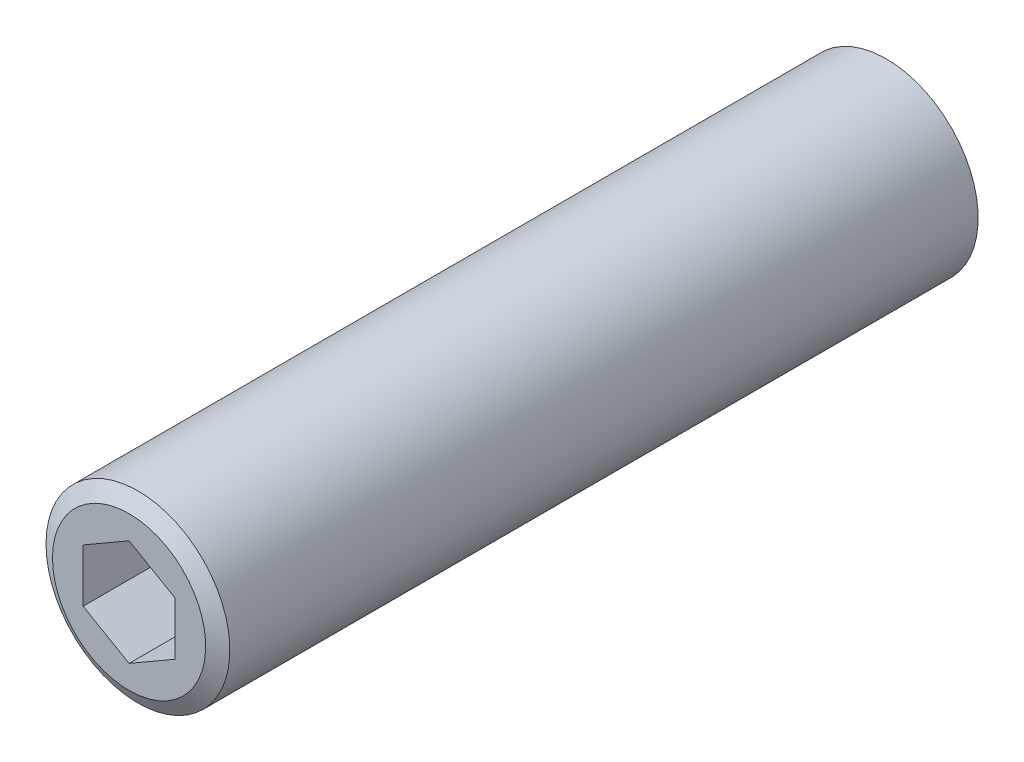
ISO-10303-21;
HEADER;
FILE_DESCRIPTION(('STEP AP214'),'2;1');
FILE_NAME('part.step','',(''),(''),'','','');
FILE_SCHEMA(('AUTOMOTIVE_DESIGN { 1 0 10303 214 1 1 1 1 }'));
ENDSEC;
DATA;
#1=APPLICATION_CONTEXT('core data for automotive mechanical design processes');
#2=APPLICATION_PROTOCOL_DEFINITION('international standard','automotive_design',2000,#1);
#3=PRODUCT_CONTEXT('',#1,'mechanical');
#4=PRODUCT('Part','Part','',(#3));
#5=PRODUCT_RELATED_PRODUCT_CATEGORY('part','',(#4));
#6=PRODUCT_DEFINITION_FORMATION('','',#4);
#7=PRODUCT_DEFINITION_CONTEXT('part definition',#1,'design');
#8=PRODUCT_DEFINITION('design','',#6,#7);
#9=PRODUCT_DEFINITION_SHAPE('','',#8);
#10=(LENGTH_UNIT() NAMED_UNIT(*) SI_UNIT(.MILLI.,.METRE.));
#11=(NAMED_UNIT(*) PLANE_ANGLE_UNIT() SI_UNIT($,.RADIAN.));
#12=(NAMED_UNIT(*) SI_UNIT($,.STERADIAN.) SOLID_ANGLE_UNIT());
#13=UNCERTAINTY_MEASURE_WITH_UNIT(LENGTH_MEASURE(1.E-05),#10,'distance_accuracy_value','');
#14=(GEOMETRIC_REPRESENTATION_CONTEXT(3) GLOBAL_UNCERTAINTY_ASSIGNED_CONTEXT((#13)) GLOBAL_UNIT_ASSIGNED_CONTEXT((#10,
#11,#12)) REPRESENTATION_CONTEXT('',''));
#15=CARTESIAN_POINT('',(0.,0.,0.));
#16=DIRECTION('',(0.,0.,1.));
#17=DIRECTION('',(1.,0.,0.));
#18=AXIS2_PLACEMENT_3D('',#15,#16,#17);
#19=CARTESIAN_POINT('',(-2.3,-5.,0.));
#20=DIRECTION('',(0.707106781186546,0.,0.707106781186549));
#21=DIRECTION('',(0.707106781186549,0.,-0.707106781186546));
#22=AXIS2_PLACEMENT_3D('',#19,#20,#21);
#23=PLANE('',#22);
#24=DIRECTION('',(0.577350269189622,-0.577350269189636,-0.57735026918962));
#25=VECTOR('',#24,1.);
#26=CARTESIAN_POINT('',(-1.4,-3.20000000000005,-0.9));
#27=LINE('',#26,#25);
#28=CARTESIAN_POINT('',(-3.45,-1.14999999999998,1.15));
#29=VERTEX_POINT('',#28);
#30=CARTESIAN_POINT('',(-2.3,-2.29999999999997,0.));
#31=VERTEX_POINT('',#30);
#32=EDGE_CURVE('E375',#29,#31,#27,.T.);
#33=ORIENTED_EDGE('',*,*,#32,.T.);
#34=DIRECTION('',(-0.57735026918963,-0.57735026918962,0.577350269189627));
#35=VECTOR('',#34,1.);
#36=CARTESIAN_POINT('',(-3.2,-3.19999999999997,0.9));
#37=LINE('',#36,#35);
#38=CARTESIAN_POINT('',(-2.79307178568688,-2.79307178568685,0.493071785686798));
#39=VERTEX_POINT('',#38);
#40=EDGE_CURVE('E355',#31,#39,#37,.T.);
#41=ORIENTED_EDGE('',*,*,#40,.T.);
#42=CARTESIAN_POINT('',(0.,0.,-2.3));
#43=DIRECTION('',(0.707106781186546,0.,0.707106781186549));
#44=DIRECTION('',(-0.707106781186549,0.,0.707106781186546));
#45=AXIS2_PLACEMENT_3D('',#42,#43,#44);
#46=ELLIPSE('',#45,5.58614357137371,3.95);
#47=CARTESIAN_POINT('',(-3.45,-1.92353840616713,1.15));
#48=VERTEX_POINT('',#47);
#49=EDGE_CURVE('E433',#48,#39,#46,.T.);
#50=ORIENTED_EDGE('',*,*,#49,.F.);
#51=DIRECTION('',(0.,1.,0.));
#52=VECTOR('',#51,1.);
#53=CARTESIAN_POINT('',(-3.45,-5.,1.15));
#54=LINE('',#53,#52);
#55=EDGE_CURVE('E404',#48,#29,#54,.T.);
#56=ORIENTED_EDGE('',*,*,#55,.T.);
#57=EDGE_LOOP('',(#33,#41,#50,#56));
#58=FACE_BOUND('',#57,.T.);
#59=ADVANCED_FACE('F15',(#58),#23,.F.);
#60=CARTESIAN_POINT('',(-2.79307178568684,2.79307178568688,0.493071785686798));
#61=VERTEX_POINT('',#60);
#62=CARTESIAN_POINT('',(-3.45,1.92353840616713,1.15));
#63=VERTEX_POINT('',#62);
#64=EDGE_CURVE('E438',#61,#63,#46,.T.);
#65=ORIENTED_EDGE('',*,*,#64,.F.);
#66=DIRECTION('',(0.577350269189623,-0.577350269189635,-0.57735026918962));
#67=VECTOR('',#66,1.);
#68=CARTESIAN_POINT('',(0.13333333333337,-0.133333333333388,-2.4333333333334));
#69=LINE('',#68,#67);
#70=CARTESIAN_POINT('',(-2.3,2.29999999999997,0.));
#71=VERTEX_POINT('',#70);
#72=EDGE_CURVE('E325',#61,#71,#69,.T.);
#73=ORIENTED_EDGE('',*,*,#72,.T.);
#74=DIRECTION('',(-0.577350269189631,-0.577350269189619,0.577350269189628));
#75=VECTOR('',#74,1.);
#76=CARTESIAN_POINT('',(-4.73333333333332,-0.133333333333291,2.4333333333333));
#77=LINE('',#76,#75);
#78=CARTESIAN_POINT('',(-3.45,1.15,1.15));
#79=VERTEX_POINT('',#78);
#80=EDGE_CURVE('E300',#71,#79,#77,.T.);
#81=ORIENTED_EDGE('',*,*,#80,.T.);
#82=EDGE_CURVE('E410',#79,#63,#54,.T.);
#83=ORIENTED_EDGE('',*,*,#82,.T.);
#84=EDGE_LOOP('',(#65,#73,#81,#83));
#85=FACE_BOUND('',#84,.T.);
#86=ADVANCED_FACE('F596',(#85),#23,.F.);
#87=CARTESIAN_POINT('',(2.3,-5.,0.));
#88=DIRECTION('',(-0.707106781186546,0.,0.707106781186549));
#89=DIRECTION('',(0.707106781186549,0.,0.707106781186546));
#90=AXIS2_PLACEMENT_3D('',#87,#88,#89);
#91=PLANE('',#90);
#92=CARTESIAN_POINT('',(0.,0.,-2.3));
#93=DIRECTION('',(-0.707106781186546,0.,0.707106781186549));
#94=DIRECTION('',(0.707106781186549,0.,0.707106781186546));
#95=AXIS2_PLACEMENT_3D('',#92,#93,#94);
#96=ELLIPSE('',#95,5.58614357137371,3.95);
#97=CARTESIAN_POINT('',(2.79307178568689,-2.79307178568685,0.493071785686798));
#98=VERTEX_POINT('',#97);
#99=CARTESIAN_POINT('',(3.45,-1.92353840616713,1.15));
#100=VERTEX_POINT('',#99);
#101=EDGE_CURVE('E426',#98,#100,#96,.T.);
#102=ORIENTED_EDGE('',*,*,#101,.F.);
#103=DIRECTION('',(-0.57735026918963,0.57735026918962,-0.577350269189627));
#104=VECTOR('',#103,1.);
#105=CARTESIAN_POINT('',(3.2,-3.19999999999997,0.9));
#106=LINE('',#105,#104);
#107=CARTESIAN_POINT('',(2.3,-2.3,0.));
#108=VERTEX_POINT('',#107);
#109=EDGE_CURVE('E338',#98,#108,#106,.T.);
#110=ORIENTED_EDGE('',*,*,#109,.T.);
#111=DIRECTION('',(0.577350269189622,0.577350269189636,0.57735026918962));
#112=VECTOR('',#111,1.);
#113=CARTESIAN_POINT('',(1.4,-3.20000000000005,-0.9));
#114=LINE('',#113,#112);
#115=CARTESIAN_POINT('',(3.45,-1.14999999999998,1.15));
#116=VERTEX_POINT('',#115);
#117=EDGE_CURVE('E363',#108,#116,#114,.T.);
#118=ORIENTED_EDGE('',*,*,#117,.T.);
#119=DIRECTION('',(0.,1.,0.));
#120=VECTOR('',#119,1.);
#121=CARTESIAN_POINT('',(3.45,-5.,1.15));
#122=LINE('',#121,#120);
#123=EDGE_CURVE('E411',#100,#116,#122,.T.);
#124=ORIENTED_EDGE('',*,*,#123,.F.);
#125=EDGE_LOOP('',(#102,#110,#118,#124));
#126=FACE_BOUND('',#125,.T.);
#127=ADVANCED_FACE('F635',(#126),#91,.F.);
#128=DIRECTION('',(-0.577350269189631,0.577350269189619,-0.577350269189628));
#129=VECTOR('',#128,1.);
#130=CARTESIAN_POINT('',(4.73333333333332,-0.133333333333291,2.4333333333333));
#131=LINE('',#130,#129);
#132=CARTESIAN_POINT('',(3.45,1.15000000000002,1.15));
#133=VERTEX_POINT('',#132);
#134=CARTESIAN_POINT('',(2.30000000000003,2.3,0.));
#135=VERTEX_POINT('',#134);
#136=EDGE_CURVE('E288',#133,#135,#131,.T.);
#137=ORIENTED_EDGE('',*,*,#136,.T.);
#138=DIRECTION('',(0.577350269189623,0.577350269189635,0.57735026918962));
#139=VECTOR('',#138,1.);
#140=CARTESIAN_POINT('',(-0.133333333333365,-0.133333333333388,-2.4333333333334));
#141=LINE('',#140,#139);
#142=CARTESIAN_POINT('',(2.79307178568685,2.79307178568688,0.493071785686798));
#143=VERTEX_POINT('',#142);
#144=EDGE_CURVE('E308',#135,#143,#141,.T.);
#145=ORIENTED_EDGE('',*,*,#144,.T.);
#146=CARTESIAN_POINT('',(3.45,1.92353840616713,1.15));
#147=VERTEX_POINT('',#146);
#148=EDGE_CURVE('E430',#147,#143,#96,.T.);
#149=ORIENTED_EDGE('',*,*,#148,.F.);
#150=EDGE_CURVE('E416',#133,#147,#122,.T.);
#151=ORIENTED_EDGE('',*,*,#150,.F.);
#152=EDGE_LOOP('',(#137,#145,#149,#151));
#153=FACE_BOUND('',#152,.T.);
#154=ADVANCED_FACE('F504',(#153),#91,.F.);
#155=CARTESIAN_POINT('',(0.,0.,46.27));
#156=DIRECTION('',(0.,0.,1.));
#157=DIRECTION('',(1.,0.,0.));
#158=AXIS2_PLACEMENT_3D('',#155,#156,#157);
#159=CYLINDRICAL_SURFACE('',#158,3.95);
#160=CARTESIAN_POINT('',(0.,0.,1.27));
#161=DIRECTION('',(0.,0.,1.));
#162=DIRECTION('',(1.,0.,0.));
#163=AXIS2_PLACEMENT_3D('',#160,#161,#162);
#164=CIRCLE('',#163,3.95);
#165=CARTESIAN_POINT('',(3.95,0.,1.27));
#166=VERTEX_POINT('',#165);
#167=EDGE_CURVE('E422',#166,#166,#164,.T.);
#168=ORIENTED_EDGE('',*,*,#167,.F.);
#169=EDGE_LOOP('',(#168));
#170=FACE_BOUND('',#169,.T.);
#171=CARTESIAN_POINT('',(0.,0.,1.15));
#172=DIRECTION('',(0.,0.,1.));
#173=DIRECTION('',(0.,1.,0.));
#174=AXIS2_PLACEMENT_3D('',#171,#172,#173);
#175=CIRCLE('',#174,3.95);
#176=CARTESIAN_POINT('',(-1.92353840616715,-3.45,1.15));
#177=VERTEX_POINT('',#176);
#178=CARTESIAN_POINT('',(1.92353840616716,-3.45,1.15));
#179=VERTEX_POINT('',#178);
#180=EDGE_CURVE('E331',#177,#179,#175,.T.);
#181=ORIENTED_EDGE('',*,*,#180,.T.);
#182=CARTESIAN_POINT('',(0.,0.,-2.3));
#183=DIRECTION('',(0.,0.707106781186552,0.707106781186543));
#184=DIRECTION('',(0.,-0.707106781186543,0.707106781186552));
#185=AXIS2_PLACEMENT_3D('',#182,#183,#184);
#186=ELLIPSE('',#185,5.58614357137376,3.95);
#187=EDGE_CURVE('E346',#179,#98,#186,.T.);
#188=ORIENTED_EDGE('',*,*,#187,.T.);
#189=ORIENTED_EDGE('',*,*,#101,.T.);
#190=CARTESIAN_POINT('',(0.,0.,1.15));
#191=DIRECTION('',(0.,0.,1.));
#192=DIRECTION('',(1.,0.,0.));
#193=AXIS2_PLACEMENT_3D('',#190,#191,#192);
#194=CIRCLE('',#193,3.95);
#195=EDGE_CURVE('E429',#100,#147,#194,.T.);
#196=ORIENTED_EDGE('',*,*,#195,.T.);
#197=ORIENTED_EDGE('',*,*,#148,.T.);
#198=CARTESIAN_POINT('',(0.,0.,-2.3));
#199=DIRECTION('',(0.,-0.707106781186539,0.707106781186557));
#200=DIRECTION('',(0.,0.707106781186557,0.707106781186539));
#201=AXIS2_PLACEMENT_3D('',#198,#199,#200);
#202=ELLIPSE('',#201,5.58614357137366,3.95);
#203=CARTESIAN_POINT('',(1.92353840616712,3.45,1.15));
#204=VERTEX_POINT('',#203);
#205=EDGE_CURVE('E316',#143,#204,#202,.T.);
#206=ORIENTED_EDGE('',*,*,#205,.T.);
#207=CARTESIAN_POINT('',(0.,0.,1.15));
#208=DIRECTION('',(0.,0.,1.));
#209=DIRECTION('',(0.,1.,0.));
#210=AXIS2_PLACEMENT_3D('',#207,#208,#209);
#211=CIRCLE('',#210,3.95);
#212=CARTESIAN_POINT('',(-1.92353840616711,3.45,1.15));
#213=VERTEX_POINT('',#212);
#214=EDGE_CURVE('E328',#204,#213,#211,.T.);
#215=ORIENTED_EDGE('',*,*,#214,.T.);
#216=EDGE_CURVE('E321',#213,#61,#202,.T.);
#217=ORIENTED_EDGE('',*,*,#216,.T.);
#218=ORIENTED_EDGE('',*,*,#64,.T.);
#219=CARTESIAN_POINT('',(0.,0.,1.15));
#220=DIRECTION('',(0.,0.,1.));
#221=DIRECTION('',(1.,0.,0.));
#222=AXIS2_PLACEMENT_3D('',#219,#220,#221);
#223=CIRCLE('',#222,3.95);
#224=EDGE_CURVE('E437',#63,#48,#223,.T.);
#225=ORIENTED_EDGE('',*,*,#224,.T.);
#226=ORIENTED_EDGE('',*,*,#49,.T.);
#227=EDGE_CURVE('E351',#39,#177,#186,.T.);
#228=ORIENTED_EDGE('',*,*,#227,.T.);
#229=EDGE_LOOP('',(#181,#188,#189,#196,#197,#206,#215,#217,#218,#225,#226,#228));
#230=FACE_BOUND('',#229,.T.);
#231=ADVANCED_FACE('F498',(#170,#230),#159,.T.);
#232=CARTESIAN_POINT('',(5.,0.,1.27));
#233=DIRECTION('',(0.,0.,-1.));
#234=DIRECTION('',(-1.,0.,0.));
#235=AXIS2_PLACEMENT_3D('',#232,#233,#234);
#236=PLANE('',#235);
#237=CARTESIAN_POINT('',(0.,0.,1.27));
#238=DIRECTION('',(0.,0.,-1.));
#239=DIRECTION('',(-1.,0.,0.));
#240=AXIS2_PLACEMENT_3D('',#237,#238,#239);
#241=CIRCLE('',#240,5.);
#242=CARTESIAN_POINT('',(-5.,0.,1.27));
#243=VERTEX_POINT('',#242);
#244=EDGE_CURVE('E9',#243,#243,#241,.T.);
#245=ORIENTED_EDGE('',*,*,#244,.T.);
#246=EDGE_LOOP('',(#245));
#247=FACE_BOUND('',#246,.T.);
#248=ORIENTED_EDGE('',*,*,#167,.T.);
#249=EDGE_LOOP('',(#248));
#250=FACE_BOUND('',#249,.T.);
#251=ADVANCED_FACE('F494',(#247,#250),#236,.T.);
#252=DIRECTION('',(0.577350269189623,-0.577350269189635,-0.57735026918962));
#253=VECTOR('',#252,1.);
#254=CARTESIAN_POINT('',(-0.633333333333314,-1.66666666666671,-1.6666666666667));
#255=LINE('',#254,#253);
#256=CARTESIAN_POINT('',(-2.3,0.,0.));
#257=VERTEX_POINT('',#256);
#258=EDGE_CURVE('E280',#79,#257,#255,.T.);
#259=ORIENTED_EDGE('',*,*,#258,.T.);
#260=DIRECTION('',(-0.577350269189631,-0.577350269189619,0.577350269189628));
#261=VECTOR('',#260,1.);
#262=CARTESIAN_POINT('',(-3.96666666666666,-1.66666666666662,1.6666666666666));
#263=LINE('',#262,#261);
#264=EDGE_CURVE('E394',#257,#29,#263,.T.);
#265=ORIENTED_EDGE('',*,*,#264,.T.);
#266=EDGE_CURVE('E409',#29,#79,#54,.T.);
#267=ORIENTED_EDGE('',*,*,#266,.T.);
#268=EDGE_LOOP('',(#259,#265,#267));
#269=FACE_BOUND('',#268,.T.);
#270=ADVANCED_FACE('F497',(#269),#23,.F.);
#271=CARTESIAN_POINT('',(-3.45,-5.,1.15));
#272=DIRECTION('',(0.,0.,1.));
#273=DIRECTION('',(1.,0.,0.));
#274=AXIS2_PLACEMENT_3D('',#271,#272,#273);
#275=PLANE('',#274);
#276=ORIENTED_EDGE('',*,*,#55,.F.);
#277=ORIENTED_EDGE('',*,*,#224,.F.);
#278=ORIENTED_EDGE('',*,*,#82,.F.);
#279=ORIENTED_EDGE('',*,*,#266,.F.);
#280=EDGE_LOOP('',(#276,#277,#278,#279));
#281=FACE_BOUND('',#280,.T.);
#282=ADVANCED_FACE('F603',(#281),#275,.F.);
#283=CARTESIAN_POINT('',(3.45,-5.,1.15));
#284=DIRECTION('',(0.,0.,1.));
#285=DIRECTION('',(1.,0.,0.));
#286=AXIS2_PLACEMENT_3D('',#283,#284,#285);
#287=PLANE('',#286);
#288=ORIENTED_EDGE('',*,*,#123,.T.);
#289=EDGE_CURVE('E415',#116,#133,#122,.T.);
#290=ORIENTED_EDGE('',*,*,#289,.T.);
#291=ORIENTED_EDGE('',*,*,#150,.T.);
#292=ORIENTED_EDGE('',*,*,#195,.F.);
#293=EDGE_LOOP('',(#288,#290,#291,#292));
#294=FACE_BOUND('',#293,.T.);
#295=ADVANCED_FACE('F641',(#294),#287,.F.);
#296=ORIENTED_EDGE('',*,*,#289,.F.);
#297=DIRECTION('',(-0.577350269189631,0.577350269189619,-0.577350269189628));
#298=VECTOR('',#297,1.);
#299=CARTESIAN_POINT('',(3.96666666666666,-1.66666666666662,1.6666666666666));
#300=LINE('',#299,#298);
#301=CARTESIAN_POINT('',(2.3,0.,0.));
#302=VERTEX_POINT('',#301);
#303=EDGE_CURVE('E382',#116,#302,#300,.T.);
#304=ORIENTED_EDGE('',*,*,#303,.T.);
#305=DIRECTION('',(0.577350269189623,0.577350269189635,0.57735026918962));
#306=VECTOR('',#305,1.);
#307=CARTESIAN_POINT('',(0.63333333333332,-1.66666666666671,-1.6666666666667));
#308=LINE('',#307,#306);
#309=EDGE_CURVE('E270',#302,#133,#308,.T.);
#310=ORIENTED_EDGE('',*,*,#309,.T.);
#311=EDGE_LOOP('',(#296,#304,#310));
#312=FACE_BOUND('',#311,.T.);
#313=ADVANCED_FACE('F645',(#312),#91,.F.);
#314=CARTESIAN_POINT('',(5.,2.3,0.));
#315=DIRECTION('',(0.,-0.707106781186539,0.707106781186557));
#316=DIRECTION('',(0.,0.707106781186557,0.707106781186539));
#317=AXIS2_PLACEMENT_3D('',#314,#315,#316);
#318=PLANE('',#317);
#319=DIRECTION('',(-1.,0.,0.));
#320=VECTOR('',#319,1.);
#321=CARTESIAN_POINT('',(5.,3.45,1.15));
#322=LINE('',#321,#320);
#323=CARTESIAN_POINT('',(1.14999999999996,3.45,1.15));
#324=VERTEX_POINT('',#323);
#325=CARTESIAN_POINT('',(-1.15000000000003,3.45,1.15));
#326=VERTEX_POINT('',#325);
#327=EDGE_CURVE('E260',#324,#326,#322,.T.);
#328=ORIENTED_EDGE('',*,*,#327,.F.);
#329=DIRECTION('',(0.577350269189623,0.577350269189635,0.57735026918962));
#330=VECTOR('',#329,1.);
#331=CARTESIAN_POINT('',(-2.43333333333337,-0.133333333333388,-2.4333333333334));
#332=LINE('',#331,#330);
#333=CARTESIAN_POINT('',(0.,2.3,0.));
#334=VERTEX_POINT('',#333);
#335=EDGE_CURVE('E449',#334,#324,#332,.T.);
#336=ORIENTED_EDGE('',*,*,#335,.F.);
#337=DIRECTION('',(0.577350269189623,-0.577350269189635,-0.57735026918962));
#338=VECTOR('',#337,1.);
#339=CARTESIAN_POINT('',(2.43333333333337,-0.133333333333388,-2.4333333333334));
#340=LINE('',#339,#338);
#341=EDGE_CURVE('E312',#326,#334,#340,.T.);
#342=ORIENTED_EDGE('',*,*,#341,.F.);
#343=EDGE_LOOP('',(#328,#336,#342));
#344=FACE_BOUND('',#343,.T.);
#345=ADVANCED_FACE('F651',(#344),#318,.F.);
#346=ORIENTED_EDGE('',*,*,#144,.F.);
#347=DIRECTION('',(0.577350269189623,-0.577350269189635,-0.57735026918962));
#348=VECTOR('',#347,1.);
#349=CARTESIAN_POINT('',(3.96666666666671,0.633333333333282,-1.6666666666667));
#350=LINE('',#349,#348);
#351=EDGE_CURVE('E304',#324,#135,#350,.T.);
#352=ORIENTED_EDGE('',*,*,#351,.F.);
#353=EDGE_CURVE('E255',#204,#324,#322,.T.);
#354=ORIENTED_EDGE('',*,*,#353,.F.);
#355=ORIENTED_EDGE('',*,*,#205,.F.);
#356=EDGE_LOOP('',(#346,#352,#354,#355));
#357=FACE_BOUND('',#356,.T.);
#358=ADVANCED_FACE('F579',(#357),#318,.F.);
#359=CARTESIAN_POINT('',(5.,3.45,1.15));
#360=DIRECTION('',(0.,0.,1.));
#361=DIRECTION('',(0.,1.,0.));
#362=AXIS2_PLACEMENT_3D('',#359,#360,#361);
#363=PLANE('',#362);
#364=ORIENTED_EDGE('',*,*,#353,.T.);
#365=ORIENTED_EDGE('',*,*,#327,.T.);
#366=EDGE_CURVE('E256',#326,#213,#322,.T.);
#367=ORIENTED_EDGE('',*,*,#366,.T.);
#368=ORIENTED_EDGE('',*,*,#214,.F.);
#369=EDGE_LOOP('',(#364,#365,#367,#368));
#370=FACE_BOUND('',#369,.T.);
#371=ADVANCED_FACE('F576',(#370),#363,.F.);
#372=ORIENTED_EDGE('',*,*,#366,.F.);
#373=DIRECTION('',(0.577350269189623,0.577350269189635,0.57735026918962));
#374=VECTOR('',#373,1.);
#375=CARTESIAN_POINT('',(-3.9666666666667,0.633333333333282,-1.6666666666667));
#376=LINE('',#375,#374);
#377=EDGE_CURVE('E320',#71,#326,#376,.T.);
#378=ORIENTED_EDGE('',*,*,#377,.F.);
#379=ORIENTED_EDGE('',*,*,#72,.F.);
#380=ORIENTED_EDGE('',*,*,#216,.F.);
#381=EDGE_LOOP('',(#372,#378,#379,#380));
#382=FACE_BOUND('',#381,.T.);
#383=ADVANCED_FACE('F692',(#382),#318,.F.);
#384=CARTESIAN_POINT('',(5.,-2.3,0.));
#385=DIRECTION('',(0.,0.707106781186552,0.707106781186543));
#386=DIRECTION('',(0.,0.707106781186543,-0.707106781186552));
#387=AXIS2_PLACEMENT_3D('',#384,#385,#386);
#388=PLANE('',#387);
#389=DIRECTION('',(-0.57735026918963,0.57735026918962,-0.577350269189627));
#390=VECTOR('',#389,1.);
#391=CARTESIAN_POINT('',(0.9,-3.19999999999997,0.9));
#392=LINE('',#391,#390);
#393=CARTESIAN_POINT('',(1.15000000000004,-3.45,1.15));
#394=VERTEX_POINT('',#393);
#395=CARTESIAN_POINT('',(0.,-2.3,0.));
#396=VERTEX_POINT('',#395);
#397=EDGE_CURVE('E461',#394,#396,#392,.T.);
#398=ORIENTED_EDGE('',*,*,#397,.F.);
#399=DIRECTION('',(-1.,0.,0.));
#400=VECTOR('',#399,1.);
#401=CARTESIAN_POINT('',(5.,-3.45,1.15));
#402=LINE('',#401,#400);
#403=CARTESIAN_POINT('',(-1.14999999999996,-3.45,1.15));
#404=VERTEX_POINT('',#403);
#405=EDGE_CURVE('E254',#394,#404,#402,.T.);
#406=ORIENTED_EDGE('',*,*,#405,.T.);
#407=DIRECTION('',(-0.57735026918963,-0.57735026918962,0.577350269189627));
#408=VECTOR('',#407,1.);
#409=CARTESIAN_POINT('',(-0.9,-3.19999999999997,0.9));
#410=LINE('',#409,#408);
#411=EDGE_CURVE('E342',#396,#404,#410,.T.);
#412=ORIENTED_EDGE('',*,*,#411,.F.);
#413=EDGE_LOOP('',(#398,#406,#412));
#414=FACE_BOUND('',#413,.T.);
#415=ADVANCED_FACE('F523',(#414),#388,.F.);
#416=EDGE_CURVE('E248',#179,#394,#402,.T.);
#417=ORIENTED_EDGE('',*,*,#416,.T.);
#418=DIRECTION('',(-0.57735026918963,-0.57735026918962,0.577350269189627));
#419=VECTOR('',#418,1.);
#420=CARTESIAN_POINT('',(0.633333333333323,-3.96666666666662,1.6666666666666));
#421=LINE('',#420,#419);
#422=EDGE_CURVE('E334',#108,#394,#421,.T.);
#423=ORIENTED_EDGE('',*,*,#422,.F.);
#424=ORIENTED_EDGE('',*,*,#109,.F.);
#425=ORIENTED_EDGE('',*,*,#187,.F.);
#426=EDGE_LOOP('',(#417,#423,#424,#425));
#427=FACE_BOUND('',#426,.T.);
#428=ADVANCED_FACE('F514',(#427),#388,.F.);
#429=ORIENTED_EDGE('',*,*,#40,.F.);
#430=DIRECTION('',(-0.57735026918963,0.57735026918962,-0.577350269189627));
#431=VECTOR('',#430,1.);
#432=CARTESIAN_POINT('',(-0.633333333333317,-3.96666666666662,1.6666666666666));
#433=LINE('',#432,#431);
#434=EDGE_CURVE('E350',#404,#31,#433,.T.);
#435=ORIENTED_EDGE('',*,*,#434,.F.);
#436=EDGE_CURVE('E250',#404,#177,#402,.T.);
#437=ORIENTED_EDGE('',*,*,#436,.T.);
#438=ORIENTED_EDGE('',*,*,#227,.F.);
#439=EDGE_LOOP('',(#429,#435,#437,#438));
#440=FACE_BOUND('',#439,.T.);
#441=ADVANCED_FACE('F607',(#440),#388,.F.);
#442=CARTESIAN_POINT('',(5.,-3.45,1.15));
#443=DIRECTION('',(0.,0.,1.));
#444=DIRECTION('',(0.,1.,0.));
#445=AXIS2_PLACEMENT_3D('',#442,#443,#444);
#446=PLANE('',#445);
#447=ORIENTED_EDGE('',*,*,#436,.F.);
#448=ORIENTED_EDGE('',*,*,#405,.F.);
#449=ORIENTED_EDGE('',*,*,#416,.F.);
#450=ORIENTED_EDGE('',*,*,#180,.F.);
#451=EDGE_LOOP('',(#447,#448,#449,#450));
#452=FACE_BOUND('',#451,.T.);
#453=ADVANCED_FACE('F517',(#452),#446,.F.);
#454=CARTESIAN_POINT('',(5.,0.,0.));
#455=DIRECTION('',(0.,-0.707106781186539,0.707106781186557));
#456=DIRECTION('',(0.,0.707106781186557,0.707106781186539));
#457=AXIS2_PLACEMENT_3D('',#454,#455,#456);
#458=PLANE('',#457);
#459=DIRECTION('',(0.577350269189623,-0.577350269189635,-0.57735026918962));
#460=VECTOR('',#459,1.);
#461=CARTESIAN_POINT('',(3.2,-0.900000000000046,-0.9));
#462=LINE('',#461,#460);
#463=CARTESIAN_POINT('',(1.14999999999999,1.15,1.15));
#464=VERTEX_POINT('',#463);
#465=EDGE_CURVE('E266',#464,#302,#462,.T.);
#466=ORIENTED_EDGE('',*,*,#465,.F.);
#467=DIRECTION('',(-1.,0.,0.));
#468=VECTOR('',#467,1.);
#469=CARTESIAN_POINT('',(5.,1.15,1.15));
#470=LINE('',#469,#468);
#471=EDGE_CURVE('E261',#133,#464,#470,.T.);
#472=ORIENTED_EDGE('',*,*,#471,.F.);
#473=ORIENTED_EDGE('',*,*,#309,.F.);
#474=EDGE_LOOP('',(#466,#472,#473));
#475=FACE_BOUND('',#474,.T.);
#476=ADVANCED_FACE('F679',(#475),#458,.F.);
#477=CARTESIAN_POINT('',(5.,1.15,1.15));
#478=DIRECTION('',(0.,0.707106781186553,0.707106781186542));
#479=DIRECTION('',(0.,0.707106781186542,-0.707106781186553));
#480=AXIS2_PLACEMENT_3D('',#477,#478,#479);
#481=PLANE('',#480);
#482=ORIENTED_EDGE('',*,*,#471,.T.);
#483=DIRECTION('',(-0.577350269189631,-0.577350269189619,0.577350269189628));
#484=VECTOR('',#483,1.);
#485=CARTESIAN_POINT('',(-0.9,-0.899999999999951,3.2));
#486=LINE('',#485,#484);
#487=EDGE_CURVE('E284',#135,#464,#486,.T.);
#488=ORIENTED_EDGE('',*,*,#487,.F.);
#489=ORIENTED_EDGE('',*,*,#136,.F.);
#490=EDGE_LOOP('',(#482,#488,#489));
#491=FACE_BOUND('',#490,.T.);
#492=ADVANCED_FACE('F561',(#491),#481,.F.);
#493=CARTESIAN_POINT('',(5.,-1.14999999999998,1.15));
#494=DIRECTION('',(0.,-0.707106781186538,0.707106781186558));
#495=DIRECTION('',(0.,0.707106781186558,0.707106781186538));
#496=AXIS2_PLACEMENT_3D('',#493,#494,#495);
#497=PLANE('',#496);
#498=DIRECTION('',(0.577350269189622,-0.577350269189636,-0.57735026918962));
#499=VECTOR('',#498,1.);
#500=CARTESIAN_POINT('',(2.43333333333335,-2.43333333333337,-0.133333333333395));
#501=LINE('',#500,#499);
#502=CARTESIAN_POINT('',(1.15000000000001,-1.14999999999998,1.15));
#503=VERTEX_POINT('',#502);
#504=EDGE_CURVE('E359',#503,#108,#501,.T.);
#505=ORIENTED_EDGE('',*,*,#504,.F.);
#506=DIRECTION('',(-1.,0.,0.));
#507=VECTOR('',#506,1.);
#508=CARTESIAN_POINT('',(5.,-1.14999999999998,1.15));
#509=LINE('',#508,#507);
#510=EDGE_CURVE('E249',#116,#503,#509,.T.);
#511=ORIENTED_EDGE('',*,*,#510,.F.);
#512=ORIENTED_EDGE('',*,*,#117,.F.);
#513=EDGE_LOOP('',(#505,#511,#512));
#514=FACE_BOUND('',#513,.T.);
#515=ADVANCED_FACE('F626',(#514),#497,.F.);
#516=CARTESIAN_POINT('',(5.,0.,0.));
#517=DIRECTION('',(0.,0.707106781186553,0.707106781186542));
#518=DIRECTION('',(0.,0.707106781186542,-0.707106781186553));
#519=AXIS2_PLACEMENT_3D('',#516,#517,#518);
#520=PLANE('',#519);
#521=ORIENTED_EDGE('',*,*,#510,.T.);
#522=DIRECTION('',(-0.577350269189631,-0.577350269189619,0.577350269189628));
#523=VECTOR('',#522,1.);
#524=CARTESIAN_POINT('',(-0.133333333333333,-2.43333333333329,2.4333333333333));
#525=LINE('',#524,#523);
#526=EDGE_CURVE('E378',#302,#503,#525,.T.);
#527=ORIENTED_EDGE('',*,*,#526,.F.);
#528=ORIENTED_EDGE('',*,*,#303,.F.);
#529=EDGE_LOOP('',(#521,#527,#528));
#530=FACE_BOUND('',#529,.T.);
#531=ADVANCED_FACE('F689',(#530),#520,.F.);
#532=CARTESIAN_POINT('',(-1.15000000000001,1.15,1.15));
#533=VERTEX_POINT('',#532);
#534=EDGE_CURVE('E231',#533,#79,#470,.T.);
#535=ORIENTED_EDGE('',*,*,#534,.F.);
#536=DIRECTION('',(0.577350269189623,0.577350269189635,0.57735026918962));
#537=VECTOR('',#536,1.);
#538=CARTESIAN_POINT('',(-3.2,-0.900000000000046,-0.9));
#539=LINE('',#538,#537);
#540=EDGE_CURVE('E39',#257,#533,#539,.T.);
#541=ORIENTED_EDGE('',*,*,#540,.F.);
#542=ORIENTED_EDGE('',*,*,#258,.F.);
#543=EDGE_LOOP('',(#535,#541,#542));
#544=FACE_BOUND('',#543,.T.);
#545=ADVANCED_FACE('F680',(#544),#458,.F.);
#546=DIRECTION('',(-0.577350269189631,0.577350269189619,-0.577350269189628));
#547=VECTOR('',#546,1.);
#548=CARTESIAN_POINT('',(0.9,-0.899999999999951,3.2));
#549=LINE('',#548,#547);
#550=EDGE_CURVE('E296',#533,#71,#549,.T.);
#551=ORIENTED_EDGE('',*,*,#550,.F.);
#552=ORIENTED_EDGE('',*,*,#534,.T.);
#553=ORIENTED_EDGE('',*,*,#80,.F.);
#554=EDGE_LOOP('',(#551,#552,#553));
#555=FACE_BOUND('',#554,.T.);
#556=ADVANCED_FACE('F674',(#555),#481,.F.);
#557=DIRECTION('',(-0.577350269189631,0.577350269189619,-0.577350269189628));
#558=VECTOR('',#557,1.);
#559=CARTESIAN_POINT('',(0.133333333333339,-2.43333333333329,2.4333333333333));
#560=LINE('',#559,#558);
#561=CARTESIAN_POINT('',(-1.15,-1.14999999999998,1.15));
#562=VERTEX_POINT('',#561);
#563=EDGE_CURVE('E390',#562,#257,#560,.T.);
#564=ORIENTED_EDGE('',*,*,#563,.F.);
#565=EDGE_CURVE('E243',#562,#29,#509,.T.);
#566=ORIENTED_EDGE('',*,*,#565,.T.);
#567=ORIENTED_EDGE('',*,*,#264,.F.);
#568=EDGE_LOOP('',(#564,#566,#567));
#569=FACE_BOUND('',#568,.T.);
#570=ADVANCED_FACE('F613',(#569),#520,.F.);
#571=ORIENTED_EDGE('',*,*,#565,.F.);
#572=DIRECTION('',(0.577350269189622,0.577350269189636,0.57735026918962));
#573=VECTOR('',#572,1.);
#574=CARTESIAN_POINT('',(-2.43333333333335,-2.43333333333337,-0.133333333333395));
#575=LINE('',#574,#573);
#576=EDGE_CURVE('E371',#31,#562,#575,.T.);
#577=ORIENTED_EDGE('',*,*,#576,.F.);
#578=ORIENTED_EDGE('',*,*,#32,.F.);
#579=EDGE_LOOP('',(#571,#577,#578));
#580=FACE_BOUND('',#579,.T.);
#581=ADVANCED_FACE('F610',(#580),#497,.F.);
#582=CARTESIAN_POINT('',(-1.15,-5.,1.15));
#583=DIRECTION('',(-0.707106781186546,0.,0.707106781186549));
#584=DIRECTION('',(0.707106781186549,0.,0.707106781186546));
#585=AXIS2_PLACEMENT_3D('',#582,#583,#584);
#586=PLANE('',#585);
#587=DIRECTION('',(0.,1.,0.));
#588=VECTOR('',#587,1.);
#589=CARTESIAN_POINT('',(-1.15,-5.,1.15));
#590=LINE('',#589,#588);
#591=EDGE_CURVE('E403',#562,#533,#590,.T.);
#592=ORIENTED_EDGE('',*,*,#591,.F.);
#593=ORIENTED_EDGE('',*,*,#563,.T.);
#594=ORIENTED_EDGE('',*,*,#540,.T.);
#595=EDGE_LOOP('',(#592,#593,#594));
#596=FACE_BOUND('',#595,.T.);
#597=ADVANCED_FACE('F615',(#596),#586,.F.);
#598=CARTESIAN_POINT('',(0.,-5.,0.));
#599=DIRECTION('',(0.707106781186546,0.,0.707106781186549));
#600=DIRECTION('',(0.707106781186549,0.,-0.707106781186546));
#601=AXIS2_PLACEMENT_3D('',#598,#599,#600);
#602=PLANE('',#601);
#603=DIRECTION('',(0.577350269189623,-0.577350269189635,-0.57735026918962));
#604=VECTOR('',#603,1.);
#605=CARTESIAN_POINT('',(1.66666666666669,-1.66666666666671,-1.6666666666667));
#606=LINE('',#605,#604);
#607=CARTESIAN_POINT('',(0.,0.,0.));
#608=VERTEX_POINT('',#607);
#609=EDGE_CURVE('E274',#533,#608,#606,.T.);
#610=ORIENTED_EDGE('',*,*,#609,.T.);
#611=DIRECTION('',(-0.577350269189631,-0.577350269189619,0.577350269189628));
#612=VECTOR('',#611,1.);
#613=CARTESIAN_POINT('',(-1.66666666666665,-1.66666666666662,1.6666666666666));
#614=LINE('',#613,#612);
#615=EDGE_CURVE('E386',#608,#562,#614,.T.);
#616=ORIENTED_EDGE('',*,*,#615,.T.);
#617=ORIENTED_EDGE('',*,*,#591,.T.);
#618=EDGE_LOOP('',(#610,#616,#617));
#619=FACE_BOUND('',#618,.T.);
#620=ADVANCED_FACE('F538',(#619),#602,.F.);
#621=ORIENTED_EDGE('',*,*,#550,.T.);
#622=ORIENTED_EDGE('',*,*,#377,.T.);
#623=EDGE_CURVE('E399',#533,#326,#590,.T.);
#624=ORIENTED_EDGE('',*,*,#623,.F.);
#625=EDGE_LOOP('',(#621,#622,#624));
#626=FACE_BOUND('',#625,.T.);
#627=ADVANCED_FACE('F541',(#626),#586,.F.);
#628=ORIENTED_EDGE('',*,*,#623,.T.);
#629=ORIENTED_EDGE('',*,*,#341,.T.);
#630=DIRECTION('',(-0.577350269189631,-0.577350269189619,0.577350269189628));
#631=VECTOR('',#630,1.);
#632=CARTESIAN_POINT('',(-2.43333333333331,-0.133333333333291,2.4333333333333));
#633=LINE('',#632,#631);
#634=EDGE_CURVE('E292',#334,#533,#633,.T.);
#635=ORIENTED_EDGE('',*,*,#634,.T.);
#636=EDGE_LOOP('',(#628,#629,#635));
#637=FACE_BOUND('',#636,.T.);
#638=ADVANCED_FACE('F546',(#637),#602,.F.);
#639=EDGE_CURVE('E405',#404,#562,#590,.T.);
#640=ORIENTED_EDGE('',*,*,#639,.F.);
#641=ORIENTED_EDGE('',*,*,#434,.T.);
#642=ORIENTED_EDGE('',*,*,#576,.T.);
#643=EDGE_LOOP('',(#640,#641,#642));
#644=FACE_BOUND('',#643,.T.);
#645=ADVANCED_FACE('F530',(#644),#586,.F.);
#646=DIRECTION('',(0.577350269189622,-0.577350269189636,-0.57735026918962));
#647=VECTOR('',#646,1.);
#648=CARTESIAN_POINT('',(0.9,-3.20000000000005,-0.9));
#649=LINE('',#648,#647);
#650=EDGE_CURVE('E367',#562,#396,#649,.T.);
#651=ORIENTED_EDGE('',*,*,#650,.T.);
#652=ORIENTED_EDGE('',*,*,#411,.T.);
#653=ORIENTED_EDGE('',*,*,#639,.T.);
#654=EDGE_LOOP('',(#651,#652,#653));
#655=FACE_BOUND('',#654,.T.);
#656=ADVANCED_FACE('F527',(#655),#602,.F.);
#657=CARTESIAN_POINT('',(0.,-5.,0.));
#658=DIRECTION('',(-0.707106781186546,0.,0.707106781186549));
#659=DIRECTION('',(0.707106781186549,0.,0.707106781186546));
#660=AXIS2_PLACEMENT_3D('',#657,#658,#659);
#661=PLANE('',#660);
#662=DIRECTION('',(0.,1.,0.));
#663=VECTOR('',#662,1.);
#664=CARTESIAN_POINT('',(1.15,-5.,1.15));
#665=LINE('',#664,#663);
#666=EDGE_CURVE('E420',#503,#464,#665,.T.);
#667=ORIENTED_EDGE('',*,*,#666,.F.);
#668=DIRECTION('',(-0.577350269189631,0.577350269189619,-0.577350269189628));
#669=VECTOR('',#668,1.);
#670=CARTESIAN_POINT('',(1.66666666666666,-1.66666666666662,1.6666666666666));
#671=LINE('',#670,#669);
#672=EDGE_CURVE('E453',#503,#608,#671,.T.);
#673=ORIENTED_EDGE('',*,*,#672,.T.);
#674=DIRECTION('',(0.577350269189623,0.577350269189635,0.57735026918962));
#675=VECTOR('',#674,1.);
#676=CARTESIAN_POINT('',(-1.66666666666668,-1.66666666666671,-1.6666666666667));
#677=LINE('',#676,#675);
#678=EDGE_CURVE('E441',#608,#464,#677,.T.);
#679=ORIENTED_EDGE('',*,*,#678,.T.);
#680=EDGE_LOOP('',(#667,#673,#679));
#681=FACE_BOUND('',#680,.T.);
#682=ADVANCED_FACE('F656',(#681),#661,.F.);
#683=CARTESIAN_POINT('',(1.15,-5.,1.15));
#684=DIRECTION('',(0.707106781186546,0.,0.707106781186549));
#685=DIRECTION('',(0.707106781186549,0.,-0.707106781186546));
#686=AXIS2_PLACEMENT_3D('',#683,#684,#685);
#687=PLANE('',#686);
#688=ORIENTED_EDGE('',*,*,#465,.T.);
#689=ORIENTED_EDGE('',*,*,#526,.T.);
#690=ORIENTED_EDGE('',*,*,#666,.T.);
#691=EDGE_LOOP('',(#688,#689,#690));
#692=FACE_BOUND('',#691,.T.);
#693=ADVANCED_FACE('F653',(#692),#687,.F.);
#694=EDGE_CURVE('E265',#464,#533,#470,.T.);
#695=ORIENTED_EDGE('',*,*,#694,.F.);
#696=ORIENTED_EDGE('',*,*,#678,.F.);
#697=ORIENTED_EDGE('',*,*,#609,.F.);
#698=EDGE_LOOP('',(#695,#696,#697));
#699=FACE_BOUND('',#698,.T.);
#700=ADVANCED_FACE('F566',(#699),#458,.F.);
#701=DIRECTION('',(-0.577350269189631,0.577350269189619,-0.577350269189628));
#702=VECTOR('',#701,1.);
#703=CARTESIAN_POINT('',(2.43333333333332,-0.133333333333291,2.4333333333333));
#704=LINE('',#703,#702);
#705=EDGE_CURVE('E445',#464,#334,#704,.T.);
#706=ORIENTED_EDGE('',*,*,#705,.F.);
#707=ORIENTED_EDGE('',*,*,#694,.T.);
#708=ORIENTED_EDGE('',*,*,#634,.F.);
#709=EDGE_LOOP('',(#706,#707,#708));
#710=FACE_BOUND('',#709,.T.);
#711=ADVANCED_FACE('F550',(#710),#481,.F.);
#712=ORIENTED_EDGE('',*,*,#705,.T.);
#713=ORIENTED_EDGE('',*,*,#335,.T.);
#714=EDGE_CURVE('E398',#464,#324,#665,.T.);
#715=ORIENTED_EDGE('',*,*,#714,.F.);
#716=EDGE_LOOP('',(#712,#713,#715));
#717=FACE_BOUND('',#716,.T.);
#718=ADVANCED_FACE('F554',(#717),#661,.F.);
#719=ORIENTED_EDGE('',*,*,#714,.T.);
#720=ORIENTED_EDGE('',*,*,#351,.T.);
#721=ORIENTED_EDGE('',*,*,#487,.T.);
#722=EDGE_LOOP('',(#719,#720,#721));
#723=FACE_BOUND('',#722,.T.);
#724=ADVANCED_FACE('F557',(#723),#687,.F.);
#725=EDGE_CURVE('E421',#394,#503,#665,.T.);
#726=ORIENTED_EDGE('',*,*,#725,.F.);
#727=ORIENTED_EDGE('',*,*,#397,.T.);
#728=DIRECTION('',(0.577350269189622,0.577350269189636,0.57735026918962));
#729=VECTOR('',#728,1.);
#730=CARTESIAN_POINT('',(-0.9,-3.20000000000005,-0.9));
#731=LINE('',#730,#729);
#732=EDGE_CURVE('E457',#396,#503,#731,.T.);
#733=ORIENTED_EDGE('',*,*,#732,.T.);
#734=EDGE_LOOP('',(#726,#727,#733));
#735=FACE_BOUND('',#734,.T.);
#736=ADVANCED_FACE('F661',(#735),#661,.F.);
#737=ORIENTED_EDGE('',*,*,#504,.T.);
#738=ORIENTED_EDGE('',*,*,#422,.T.);
#739=ORIENTED_EDGE('',*,*,#725,.T.);
#740=EDGE_LOOP('',(#737,#738,#739));
#741=FACE_BOUND('',#740,.T.);
#742=ADVANCED_FACE('F658',(#741),#687,.F.);
#743=EDGE_CURVE('E247',#503,#562,#509,.T.);
#744=ORIENTED_EDGE('',*,*,#743,.F.);
#745=ORIENTED_EDGE('',*,*,#732,.F.);
#746=ORIENTED_EDGE('',*,*,#650,.F.);
#747=EDGE_LOOP('',(#744,#745,#746));
#748=FACE_BOUND('',#747,.T.);
#749=ADVANCED_FACE('F625',(#748),#497,.F.);
#750=ORIENTED_EDGE('',*,*,#672,.F.);
#751=ORIENTED_EDGE('',*,*,#743,.T.);
#752=ORIENTED_EDGE('',*,*,#615,.F.);
#753=EDGE_LOOP('',(#750,#751,#752));
#754=FACE_BOUND('',#753,.T.);
#755=ADVANCED_FACE('F486',(#754),#520,.F.);
#756=CARTESIAN_POINT('',(0.,0.,26.27));
#757=DIRECTION('',(0.,0.,-1.));
#758=DIRECTION('',(-1.,0.,0.));
#759=AXIS2_PLACEMENT_3D('',#756,#757,#758);
#760=CYLINDRICAL_SURFACE('',#759,6.);
#761=CARTESIAN_POINT('',(0.,0.,50.6926497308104));
#762=DIRECTION('',(0.,0.,-1.));
#763=DIRECTION('',(-1.,0.,0.));
#764=AXIS2_PLACEMENT_3D('',#761,#762,#763);
#765=CIRCLE('',#764,6.);
#766=CARTESIAN_POINT('',(-6.,0.,50.6926497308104));
#767=VERTEX_POINT('',#766);
#768=EDGE_CURVE('E469',#767,#767,#765,.T.);
#769=ORIENTED_EDGE('',*,*,#768,.T.);
#770=EDGE_LOOP('',(#769));
#771=FACE_BOUND('',#770,.T.);
#772=CARTESIAN_POINT('',(0.,0.,1.8473502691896));
#773=DIRECTION('',(0.,0.,-1.));
#774=DIRECTION('',(-1.,0.,0.));
#775=AXIS2_PLACEMENT_3D('',#772,#773,#774);
#776=CIRCLE('',#775,6.);
#777=CARTESIAN_POINT('',(-6.,0.,1.8473502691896));
#778=VERTEX_POINT('',#777);
#779=EDGE_CURVE('E465',#778,#778,#776,.F.);
#780=ORIENTED_EDGE('',*,*,#779,.T.);
#781=EDGE_LOOP('',(#780));
#782=FACE_BOUND('',#781,.T.);
#783=ADVANCED_FACE('F483',(#771,#782),#760,.T.);
#784=CARTESIAN_POINT('',(0.,0.,51.27));
#785=DIRECTION('',(0.,0.,-1.));
#786=DIRECTION('',(-1.,0.,0.));
#787=AXIS2_PLACEMENT_3D('',#784,#785,#786);
#788=PLANE('',#787);
#789=DIRECTION('',(-0.866025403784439,-0.5,0.));
#790=VECTOR('',#789,1.);
#791=CARTESIAN_POINT('',(0.,3.46410161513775,51.27));
#792=LINE('',#791,#790);
#793=CARTESIAN_POINT('',(0.,3.46410161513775,51.27));
#794=VERTEX_POINT('',#793);
#795=CARTESIAN_POINT('',(-3.,1.73205080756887,51.27));
#796=VERTEX_POINT('',#795);
#797=EDGE_CURVE('E214',#794,#796,#792,.T.);
#798=ORIENTED_EDGE('',*,*,#797,.F.);
#799=DIRECTION('',(-0.866025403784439,0.5,0.));
#800=VECTOR('',#799,1.);
#801=CARTESIAN_POINT('',(3.,1.73205080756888,51.27));
#802=LINE('',#801,#800);
#803=CARTESIAN_POINT('',(3.,1.73205080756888,51.27));
#804=VERTEX_POINT('',#803);
#805=EDGE_CURVE('E31',#804,#794,#802,.T.);
#806=ORIENTED_EDGE('',*,*,#805,.F.);
#807=DIRECTION('',(0.,1.,0.));
#808=VECTOR('',#807,1.);
#809=CARTESIAN_POINT('',(3.,-1.73205080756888,51.27));
#810=LINE('',#809,#808);
#811=CARTESIAN_POINT('',(3.,-1.73205080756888,51.27));
#812=VERTEX_POINT('',#811);
#813=EDGE_CURVE('E193',#812,#804,#810,.T.);
#814=ORIENTED_EDGE('',*,*,#813,.F.);
#815=DIRECTION('',(0.866025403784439,0.5,0.));
#816=VECTOR('',#815,1.);
#817=CARTESIAN_POINT('',(0.,-3.46410161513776,51.27));
#818=LINE('',#817,#816);
#819=CARTESIAN_POINT('',(0.,-3.46410161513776,51.27));
#820=VERTEX_POINT('',#819);
#821=EDGE_CURVE('E198',#820,#812,#818,.T.);
#822=ORIENTED_EDGE('',*,*,#821,.F.);
#823=DIRECTION('',(0.866025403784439,-0.5,0.));
#824=VECTOR('',#823,1.);
#825=CARTESIAN_POINT('',(-3.,-1.73205080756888,51.27));
#826=LINE('',#825,#824);
#827=CARTESIAN_POINT('',(-3.,-1.73205080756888,51.27));
#828=VERTEX_POINT('',#827);
#829=EDGE_CURVE('E221',#828,#820,#826,.T.);
#830=ORIENTED_EDGE('',*,*,#829,.F.);
#831=DIRECTION('',(0.,-1.,0.));
#832=VECTOR('',#831,1.);
#833=CARTESIAN_POINT('',(-3.,1.73205080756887,51.27));
#834=LINE('',#833,#832);
#835=EDGE_CURVE('E217',#796,#828,#834,.T.);
#836=ORIENTED_EDGE('',*,*,#835,.F.);
#837=EDGE_LOOP('',(#798,#806,#814,#822,#830,#836));
#838=FACE_BOUND('',#837,.T.);
#839=CARTESIAN_POINT('',(0.,0.,51.27));
#840=DIRECTION('',(0.,0.,-1.));
#841=DIRECTION('',(-1.,0.,0.));
#842=AXIS2_PLACEMENT_3D('',#839,#840,#841);
#843=CIRCLE('',#842,5.);
#844=CARTESIAN_POINT('',(-5.,0.,51.27));
#845=VERTEX_POINT('',#844);
#846=EDGE_CURVE('E24',#845,#845,#843,.F.);
#847=ORIENTED_EDGE('',*,*,#846,.T.);
#848=EDGE_LOOP('',(#847));
#849=FACE_BOUND('',#848,.T.);
#850=ADVANCED_FACE('F476',(#838,#849),#788,.F.);
#851=CARTESIAN_POINT('',(0.,0.,50.6926497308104));
#852=DIRECTION('',(0.,0.,-1.));
#853=DIRECTION('',(-1.,0.,0.));
#854=AXIS2_PLACEMENT_3D('',#851,#852,#853);
#855=CONICAL_SURFACE('',#854,6.,1.0471975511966);
#856=ORIENTED_EDGE('',*,*,#846,.F.);
#857=EDGE_LOOP('',(#856));
#858=FACE_BOUND('',#857,.T.);
#859=ORIENTED_EDGE('',*,*,#768,.F.);
#860=EDGE_LOOP('',(#859));
#861=FACE_BOUND('',#860,.T.);
#862=ADVANCED_FACE('F478',(#858,#861),#855,.T.);
#863=CARTESIAN_POINT('',(0.,0.,1.27));
#864=DIRECTION('',(0.,0.,1.));
#865=DIRECTION('',(1.,0.,0.));
#866=AXIS2_PLACEMENT_3D('',#863,#864,#865);
#867=CONICAL_SURFACE('',#866,5.,1.0471975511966);
#868=ORIENTED_EDGE('',*,*,#779,.F.);
#869=EDGE_LOOP('',(#868));
#870=FACE_BOUND('',#869,.T.);
#871=ORIENTED_EDGE('',*,*,#244,.F.);
#872=EDGE_LOOP('',(#871));
#873=FACE_BOUND('',#872,.T.);
#874=ADVANCED_FACE('F17',(#870,#873),#867,.T.);
#875=CARTESIAN_POINT('',(3.,1.73205080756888,46.27));
#876=DIRECTION('',(0.5,0.866025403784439,0.));
#877=DIRECTION('',(0.866025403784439,-0.5,0.));
#878=AXIS2_PLACEMENT_3D('',#875,#876,#877);
#879=PLANE('',#878);
#880=ORIENTED_EDGE('',*,*,#805,.T.);
#881=DIRECTION('',(0.,0.,1.));
#882=VECTOR('',#881,1.);
#883=CARTESIAN_POINT('',(0.,3.46410161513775,46.27));
#884=LINE('',#883,#882);
#885=CARTESIAN_POINT('',(0.,3.46410161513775,46.27));
#886=VERTEX_POINT('',#885);
#887=EDGE_CURVE('E167',#886,#794,#884,.T.);
#888=ORIENTED_EDGE('',*,*,#887,.F.);
#889=DIRECTION('',(-0.866025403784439,0.5,0.));
#890=VECTOR('',#889,1.);
#891=CARTESIAN_POINT('',(3.,1.73205080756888,46.27));
#892=LINE('',#891,#890);
#893=CARTESIAN_POINT('',(3.,1.73205080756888,46.27));
#894=VERTEX_POINT('',#893);
#895=EDGE_CURVE('E171',#894,#886,#892,.T.);
#896=ORIENTED_EDGE('',*,*,#895,.F.);
#897=DIRECTION('',(0.,0.,1.));
#898=VECTOR('',#897,1.);
#899=CARTESIAN_POINT('',(3.,1.73205080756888,46.27));
#900=LINE('',#899,#898);
#901=EDGE_CURVE('E228',#894,#804,#900,.T.);
#902=ORIENTED_EDGE('',*,*,#901,.T.);
#903=EDGE_LOOP('',(#880,#888,#896,#902));
#904=FACE_BOUND('',#903,.T.);
#905=ADVANCED_FACE('F169',(#904),#879,.F.);
#906=CARTESIAN_POINT('',(3.,-1.73205080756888,46.27));
#907=DIRECTION('',(1.,0.,0.));
#908=DIRECTION('',(0.,0.,-1.));
#909=AXIS2_PLACEMENT_3D('',#906,#907,#908);
#910=PLANE('',#909);
#911=ORIENTED_EDGE('',*,*,#813,.T.);
#912=ORIENTED_EDGE('',*,*,#901,.F.);
#913=DIRECTION('',(0.,1.,0.));
#914=VECTOR('',#913,1.);
#915=CARTESIAN_POINT('',(3.,-1.73205080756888,46.27));
#916=LINE('',#915,#914);
#917=CARTESIAN_POINT('',(3.,-1.73205080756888,46.27));
#918=VERTEX_POINT('',#917);
#919=EDGE_CURVE('E178',#918,#894,#916,.T.);
#920=ORIENTED_EDGE('',*,*,#919,.F.);
#921=DIRECTION('',(0.,0.,1.));
#922=VECTOR('',#921,1.);
#923=CARTESIAN_POINT('',(3.,-1.73205080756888,46.27));
#924=LINE('',#923,#922);
#925=EDGE_CURVE('E232',#918,#812,#924,.T.);
#926=ORIENTED_EDGE('',*,*,#925,.T.);
#927=EDGE_LOOP('',(#911,#912,#920,#926));
#928=FACE_BOUND('',#927,.T.);
#929=ADVANCED_FACE('F978',(#928),#910,.F.);
#930=CARTESIAN_POINT('',(0.,-3.46410161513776,46.27));
#931=DIRECTION('',(0.5,-0.866025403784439,0.));
#932=DIRECTION('',(-0.866025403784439,-0.5,0.));
#933=AXIS2_PLACEMENT_3D('',#930,#931,#932);
#934=PLANE('',#933);
#935=ORIENTED_EDGE('',*,*,#821,.T.);
#936=ORIENTED_EDGE('',*,*,#925,.F.);
#937=DIRECTION('',(0.866025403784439,0.5,0.));
#938=VECTOR('',#937,1.);
#939=CARTESIAN_POINT('',(0.,-3.46410161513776,46.27));
#940=LINE('',#939,#938);
#941=CARTESIAN_POINT('',(0.,-3.46410161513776,46.27));
#942=VERTEX_POINT('',#941);
#943=EDGE_CURVE('E207',#942,#918,#940,.T.);
#944=ORIENTED_EDGE('',*,*,#943,.F.);
#945=DIRECTION('',(0.,0.,1.));
#946=VECTOR('',#945,1.);
#947=CARTESIAN_POINT('',(0.,-3.46410161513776,46.27));
#948=LINE('',#947,#946);
#949=EDGE_CURVE('E235',#942,#820,#948,.T.);
#950=ORIENTED_EDGE('',*,*,#949,.T.);
#951=EDGE_LOOP('',(#935,#936,#944,#950));
#952=FACE_BOUND('',#951,.T.);
#953=ADVANCED_FACE('F986',(#952),#934,.F.);
#954=CARTESIAN_POINT('',(-3.,-1.73205080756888,46.27));
#955=DIRECTION('',(-0.5,-0.866025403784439,0.));
#956=DIRECTION('',(-0.866025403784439,0.5,0.));
#957=AXIS2_PLACEMENT_3D('',#954,#955,#956);
#958=PLANE('',#957);
#959=ORIENTED_EDGE('',*,*,#829,.T.);
#960=ORIENTED_EDGE('',*,*,#949,.F.);
#961=DIRECTION('',(0.866025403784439,-0.5,0.));
#962=VECTOR('',#961,1.);
#963=CARTESIAN_POINT('',(-3.,-1.73205080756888,46.27));
#964=LINE('',#963,#962);
#965=CARTESIAN_POINT('',(-3.,-1.73205080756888,46.27));
#966=VERTEX_POINT('',#965);
#967=EDGE_CURVE('E203',#966,#942,#964,.T.);
#968=ORIENTED_EDGE('',*,*,#967,.F.);
#969=DIRECTION('',(0.,0.,1.));
#970=VECTOR('',#969,1.);
#971=CARTESIAN_POINT('',(-3.,-1.73205080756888,46.27));
#972=LINE('',#971,#970);
#973=EDGE_CURVE('E238',#966,#828,#972,.T.);
#974=ORIENTED_EDGE('',*,*,#973,.T.);
#975=EDGE_LOOP('',(#959,#960,#968,#974));
#976=FACE_BOUND('',#975,.T.);
#977=ADVANCED_FACE('F995',(#976),#958,.F.);
#978=CARTESIAN_POINT('',(-3.,1.73205080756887,46.27));
#979=DIRECTION('',(-1.,0.,0.));
#980=DIRECTION('',(0.,0.,1.));
#981=AXIS2_PLACEMENT_3D('',#978,#979,#980);
#982=PLANE('',#981);
#983=ORIENTED_EDGE('',*,*,#835,.T.);
#984=ORIENTED_EDGE('',*,*,#973,.F.);
#985=DIRECTION('',(0.,-1.,0.));
#986=VECTOR('',#985,1.);
#987=CARTESIAN_POINT('',(-3.,1.73205080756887,46.27));
#988=LINE('',#987,#986);
#989=CARTESIAN_POINT('',(-3.,1.73205080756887,46.27));
#990=VERTEX_POINT('',#989);
#991=EDGE_CURVE('E187',#990,#966,#988,.T.);
#992=ORIENTED_EDGE('',*,*,#991,.F.);
#993=DIRECTION('',(0.,0.,1.));
#994=VECTOR('',#993,1.);
#995=CARTESIAN_POINT('',(-3.,1.73205080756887,46.27));
#996=LINE('',#995,#994);
#997=EDGE_CURVE('E177',#990,#796,#996,.T.);
#998=ORIENTED_EDGE('',*,*,#997,.T.);
#999=EDGE_LOOP('',(#983,#984,#992,#998));
#1000=FACE_BOUND('',#999,.T.);
#1001=ADVANCED_FACE('F1004',(#1000),#982,.F.);
#1002=CARTESIAN_POINT('',(0.,3.46410161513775,46.27));
#1003=DIRECTION('',(-0.5,0.866025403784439,0.));
#1004=DIRECTION('',(0.866025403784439,0.5,0.));
#1005=AXIS2_PLACEMENT_3D('',#1002,#1003,#1004);
#1006=PLANE('',#1005);
#1007=ORIENTED_EDGE('',*,*,#797,.T.);
#1008=ORIENTED_EDGE('',*,*,#997,.F.);
#1009=DIRECTION('',(-0.866025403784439,-0.5,0.));
#1010=VECTOR('',#1009,1.);
#1011=CARTESIAN_POINT('',(0.,3.46410161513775,46.27));
#1012=LINE('',#1011,#1010);
#1013=EDGE_CURVE('E181',#886,#990,#1012,.T.);
#1014=ORIENTED_EDGE('',*,*,#1013,.F.);
#1015=ORIENTED_EDGE('',*,*,#887,.T.);
#1016=EDGE_LOOP('',(#1007,#1008,#1014,#1015));
#1017=FACE_BOUND('',#1016,.T.);
#1018=ADVANCED_FACE('F182',(#1017),#1006,.F.);
#1019=CARTESIAN_POINT('',(0.,3.46410161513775,46.27));
#1020=DIRECTION('',(0.,0.,1.));
#1021=DIRECTION('',(1.,0.,0.));
#1022=AXIS2_PLACEMENT_3D('',#1019,#1020,#1021);
#1023=PLANE('',#1022);
#1024=ORIENTED_EDGE('',*,*,#895,.T.);
#1025=ORIENTED_EDGE('',*,*,#1013,.T.);
#1026=ORIENTED_EDGE('',*,*,#991,.T.);
#1027=ORIENTED_EDGE('',*,*,#967,.T.);
#1028=ORIENTED_EDGE('',*,*,#943,.T.);
#1029=ORIENTED_EDGE('',*,*,#919,.T.);
#1030=EDGE_LOOP('',(#1024,#1025,#1026,#1027,#1028,#1029));
#1031=FACE_BOUND('',#1030,.T.);
#1032=ADVANCED_FACE('F189',(#1031),#1023,.T.);
#1033=CLOSED_SHELL('',(#59,#86,#127,#154,#231,#251,#270,#282,#295,#313,#345,#358,#371,#383,#415,
#428,#441,#453,#476,#492,#515,#531,#545,#556,#570,#581,#597,#620,#627,#638,#645,#656,#682,#693,
#700,#711,#718,#724,#736,#742,#749,#755,#783,#850,#862,#874,#905,#929,#953,#977,#1001,#1018,#1032));
#1034=MANIFOLD_SOLID_BREP('B1',#1033);
#1035=ADVANCED_BREP_SHAPE_REPRESENTATION('',(#18,#1034),#14);
#1036=SHAPE_DEFINITION_REPRESENTATION(#9,#1035);
ENDSEC;
END-ISO-10303-21;
